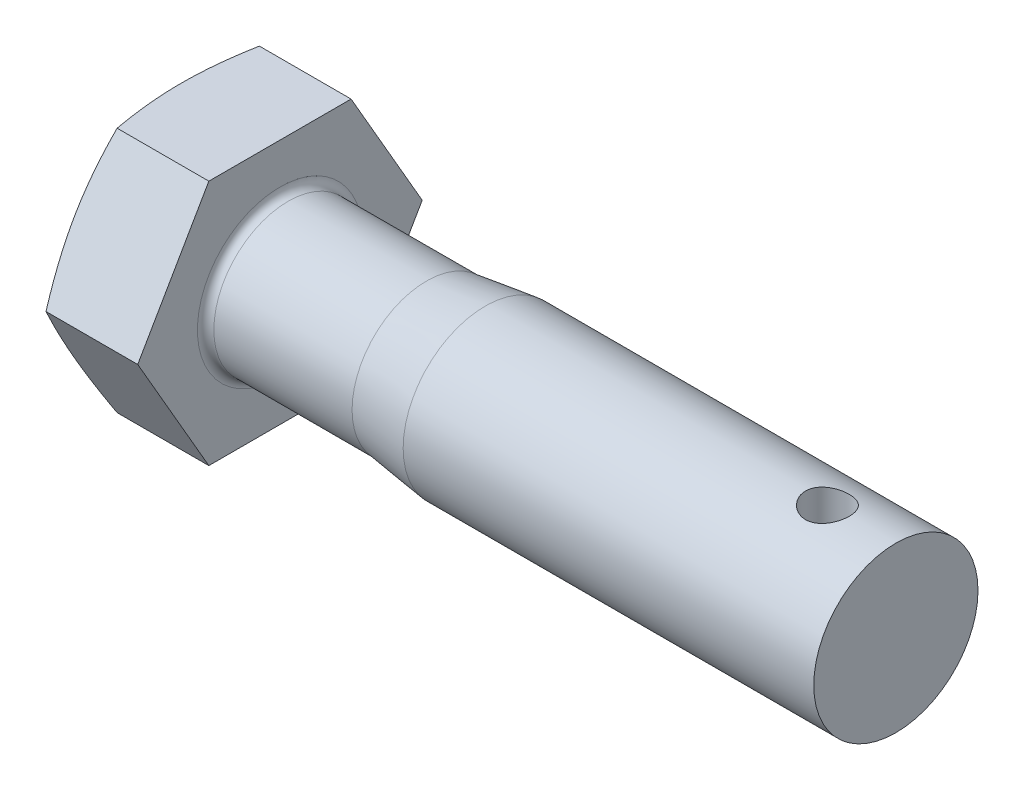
ISO-10303-21;
HEADER;
FILE_DESCRIPTION(('STEP AP214'),'2;1');
FILE_NAME('part.step','',(''),(''),'','','');
FILE_SCHEMA(('AUTOMOTIVE_DESIGN { 1 0 10303 214 1 1 1 1 }'));
ENDSEC;
DATA;
#1=APPLICATION_CONTEXT('core data for automotive mechanical design processes');
#2=APPLICATION_PROTOCOL_DEFINITION('international standard','automotive_design',2000,#1);
#3=PRODUCT_CONTEXT('',#1,'mechanical');
#4=PRODUCT('Part','Part','',(#3));
#5=PRODUCT_RELATED_PRODUCT_CATEGORY('part','',(#4));
#6=PRODUCT_DEFINITION_FORMATION('','',#4);
#7=PRODUCT_DEFINITION_CONTEXT('part definition',#1,'design');
#8=PRODUCT_DEFINITION('design','',#6,#7);
#9=PRODUCT_DEFINITION_SHAPE('','',#8);
#10=(LENGTH_UNIT() NAMED_UNIT(*) SI_UNIT(.MILLI.,.METRE.));
#11=(NAMED_UNIT(*) PLANE_ANGLE_UNIT() SI_UNIT($,.RADIAN.));
#12=(NAMED_UNIT(*) SI_UNIT($,.STERADIAN.) SOLID_ANGLE_UNIT());
#13=UNCERTAINTY_MEASURE_WITH_UNIT(LENGTH_MEASURE(1.E-05),#10,'distance_accuracy_value','');
#14=(GEOMETRIC_REPRESENTATION_CONTEXT(3) GLOBAL_UNCERTAINTY_ASSIGNED_CONTEXT((#13)) GLOBAL_UNIT_ASSIGNED_CONTEXT((#10,
#11,#12)) REPRESENTATION_CONTEXT('',''));
#15=CARTESIAN_POINT('',(0.,0.,0.));
#16=DIRECTION('',(0.,0.,1.));
#17=DIRECTION('',(1.,0.,0.));
#18=AXIS2_PLACEMENT_3D('',#15,#16,#17);
#19=CARTESIAN_POINT('',(0.,-9.,-5.19615242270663));
#20=DIRECTION('',(1.,0.,0.));
#21=DIRECTION('',(0.,0.,-1.));
#22=AXIS2_PLACEMENT_3D('',#19,#20,#21);
#23=PLANE('',#22);
#24=CARTESIAN_POINT('',(0.,0.,0.));
#25=DIRECTION('',(-1.,0.,0.));
#26=DIRECTION('',(0.,0.,1.));
#27=AXIS2_PLACEMENT_3D('',#24,#25,#26);
#28=CIRCLE('',#27,8.2);
#29=CARTESIAN_POINT('',(0.,0.,8.2));
#30=VERTEX_POINT('',#29);
#31=EDGE_CURVE('E98',#30,#30,#28,.T.);
#32=ORIENTED_EDGE('',*,*,#31,.T.);
#33=EDGE_LOOP('',(#32));
#34=FACE_BOUND('',#33,.T.);
#35=CARTESIAN_POINT('',(0.,0.,0.));
#36=DIRECTION('',(1.,0.,0.));
#37=DIRECTION('',(0.,0.,-1.));
#38=AXIS2_PLACEMENT_3D('',#35,#36,#37);
#39=CIRCLE('',#38,6.85);
#40=CARTESIAN_POINT('',(0.,0.,-6.85));
#41=VERTEX_POINT('',#40);
#42=EDGE_CURVE('E231',#41,#41,#39,.T.);
#43=ORIENTED_EDGE('',*,*,#42,.T.);
#44=EDGE_LOOP('',(#43));
#45=FACE_BOUND('',#44,.T.);
#46=ADVANCED_FACE('F32',(#34,#45),#23,.F.);
#47=CARTESIAN_POINT('',(7.5,-9.,5.19615242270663));
#48=DIRECTION('',(0.,1.,0.));
#49=DIRECTION('',(0.,0.,1.));
#50=AXIS2_PLACEMENT_3D('',#47,#48,#49);
#51=PLANE('',#50);
#52=CARTESIAN_POINT('',(2.99064695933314,-9.,-13.7298648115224));
#53=CARTESIAN_POINT('',(2.86681811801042,-9.,-13.3229547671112));
#54=CARTESIAN_POINT('',(2.74444035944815,-9.,-12.9155948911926));
#55=CARTESIAN_POINT('',(2.50338984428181,-9.,-12.0997465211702));
#56=CARTESIAN_POINT('',(2.384717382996,-9.,-11.6912579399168));
#57=CARTESIAN_POINT('',(2.15168119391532,-9.,-10.8722179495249));
#58=CARTESIAN_POINT('',(2.03732599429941,-9.,-10.461664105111));
#59=CARTESIAN_POINT('',(1.81427035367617,-9.,-9.63902527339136));
#60=CARTESIAN_POINT('',(1.70556981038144,-9.,-9.22694031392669));
#61=CARTESIAN_POINT('',(1.49653390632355,-9.,-8.40611060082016));
#62=CARTESIAN_POINT('',(1.39611119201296,-9.,-7.99738820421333));
#63=CARTESIAN_POINT('',(1.20385742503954,-9.,-7.17790644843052));
#64=CARTESIAN_POINT('',(1.11202651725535,-9.,-6.76714705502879));
#65=CARTESIAN_POINT('',(0.939106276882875,-9.,-5.94350445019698));
#66=CARTESIAN_POINT('',(0.858013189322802,-9.,-5.5306220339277));
#67=CARTESIAN_POINT('',(0.709045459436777,-9.,-4.70246163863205));
#68=CARTESIAN_POINT('',(0.641170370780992,-9.,-4.28718374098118));
#69=CARTESIAN_POINT('',(0.528125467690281,-9.,-3.5010438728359));
#70=CARTESIAN_POINT('',(0.481262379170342,-9.,-3.13042767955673));
#71=CARTESIAN_POINT('',(0.40202672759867,-9.,-2.38763662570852));
#72=CARTESIAN_POINT('',(0.369653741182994,-9.,-2.01546181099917));
#73=CARTESIAN_POINT('',(0.32095772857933,-9.,-1.27030896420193));
#74=CARTESIAN_POINT('',(0.304623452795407,-9.,-0.897331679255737));
#75=CARTESIAN_POINT('',(0.288831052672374,-9.,-0.151016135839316));
#76=CARTESIAN_POINT('',(0.289372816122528,-9.,0.222322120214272));
#77=CARTESIAN_POINT('',(0.307348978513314,-9.,0.970502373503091));
#78=CARTESIAN_POINT('',(0.324870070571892,-9.,1.34534225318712));
#79=CARTESIAN_POINT('',(0.375999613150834,-9.,2.09391368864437));
#80=CARTESIAN_POINT('',(0.409608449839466,-9.,2.46764521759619));
#81=CARTESIAN_POINT('',(0.491347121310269,-9.,3.21381849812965));
#82=CARTESIAN_POINT('',(0.539489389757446,-9.,3.58625886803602));
#83=CARTESIAN_POINT('',(0.648350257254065,-9.,4.32927613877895));
#84=CARTESIAN_POINT('',(0.709068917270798,-9.,4.69985303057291));
#85=CARTESIAN_POINT('',(0.845019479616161,-9.,5.46095124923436));
#86=CARTESIAN_POINT('',(0.920897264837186,-9.,5.85135619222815));
#87=CARTESIAN_POINT('',(1.08241874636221,-9.,6.63015355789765));
#88=CARTESIAN_POINT('',(1.16806318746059,-9.,7.01854582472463));
#89=CARTESIAN_POINT('',(1.34731089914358,-9.,7.79359854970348));
#90=CARTESIAN_POINT('',(1.440916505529,-9.,8.18025846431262));
#91=CARTESIAN_POINT('',(1.63455842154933,-9.,8.95194677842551));
#92=CARTESIAN_POINT('',(1.73459457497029,-9.,9.33697521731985));
#93=CARTESIAN_POINT('',(1.94002323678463,-9.,10.1061283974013));
#94=CARTESIAN_POINT('',(2.04542249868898,-9.,10.4902513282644));
#95=CARTESIAN_POINT('',(2.26049354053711,-9.,11.2572975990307));
#96=CARTESIAN_POINT('',(2.37016533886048,-9.,11.6402209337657));
#97=CARTESIAN_POINT('',(2.59299503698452,-9.,12.4049775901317));
#98=CARTESIAN_POINT('',(2.70615232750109,-9.,12.7868110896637));
#99=CARTESIAN_POINT('',(2.93536874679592,-9.,13.5496070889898));
#100=CARTESIAN_POINT('',(3.05142789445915,-9.,13.9305695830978));
#101=CARTESIAN_POINT('',(3.4005426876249,-9.,15.0637009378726));
#102=CARTESIAN_POINT('',(3.6370911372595,-9.,15.8147934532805));
#103=CARTESIAN_POINT('',(4.11685079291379,-9.,17.31487684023));
#104=CARTESIAN_POINT('',(4.36006232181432,-9.,18.063867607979));
#105=CARTESIAN_POINT('',(4.85043402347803,-9.,19.5573981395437));
#106=CARTESIAN_POINT('',(5.09757565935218,-9.,20.3019439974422));
#107=CARTESIAN_POINT('',(5.47101079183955,-9.,21.4178157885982));
#108=CARTESIAN_POINT('',(5.59593784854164,-9.,21.7896002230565));
#109=CARTESIAN_POINT('',(5.84659472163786,-9.,22.5328974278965));
#110=CARTESIAN_POINT('',(5.9723245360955,-9.,22.9044101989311));
#111=CARTESIAN_POINT('',(6.0984020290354,-9.,23.2758050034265));
#112=B_SPLINE_CURVE_WITH_KNOTS('',3,(#52,#53,#54,#55,#56,#57,#58,#59,#60,#61,#62,#63,#64,#65,
#66,#67,#68,#69,#70,#71,#72,#73,#74,#75,#76,#77,#78,#79,#80,#81,#82,#83,#84,#85,#86,#87,#88,#89,
#90,#91,#92,#93,#94,#95,#96,#97,#98,#99,#100,#101,#102,#103,#104,#105,#106,#107,#108,#109,#110,
#111),.UNSPECIFIED.,.F.,.F.,(4,2,2,2,2,2,2,2,2,2,2,2,2,2,2,2,2,2,2,2,2,2,2,2,2,2,2,2,2,4),(0.,
1.27601235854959,2.55212615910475,3.83064128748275,5.10913328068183,6.37169542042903,
7.63427884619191,8.89641957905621,10.1585176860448,11.278972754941,12.3993950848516,
13.5190309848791,14.6386594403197,15.7640347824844,16.8894371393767,18.0158050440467,
19.1421784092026,20.335155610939,21.5282238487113,22.7216433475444,23.9150338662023,
25.1099662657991,26.3049038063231,27.4996336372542,28.6943712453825,31.0567042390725,
33.4191519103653,35.7726141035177,36.9492501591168,38.1258833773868),.UNSPECIFIED.);
#113=CARTESIAN_POINT('',(0.797933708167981,-9.00000000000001,-5.19615242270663));
#114=VERTEX_POINT('',#113);
#115=CARTESIAN_POINT('',(0.79793370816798,-9.,5.19615242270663));
#116=VERTEX_POINT('',#115);
#117=EDGE_CURVE('E54',#114,#116,#112,.T.);
#118=ORIENTED_EDGE('',*,*,#117,.F.);
#119=DIRECTION('',(-1.,0.,0.));
#120=VECTOR('',#119,1.);
#121=CARTESIAN_POINT('',(7.5,-9.,-5.19615242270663));
#122=LINE('',#121,#120);
#123=CARTESIAN_POINT('',(7.5,-9.,-5.19615242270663));
#124=VERTEX_POINT('',#123);
#125=EDGE_CURVE('E123',#124,#114,#122,.T.);
#126=ORIENTED_EDGE('',*,*,#125,.F.);
#127=DIRECTION('',(0.,0.,-1.));
#128=VECTOR('',#127,1.);
#129=CARTESIAN_POINT('',(7.5,-9.,5.19615242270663));
#130=LINE('',#129,#128);
#131=CARTESIAN_POINT('',(7.5,-9.,5.19615242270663));
#132=VERTEX_POINT('',#131);
#133=EDGE_CURVE('E260',#132,#124,#130,.T.);
#134=ORIENTED_EDGE('',*,*,#133,.F.);
#135=DIRECTION('',(-1.,0.,0.));
#136=VECTOR('',#135,1.);
#137=CARTESIAN_POINT('',(7.5,-9.,5.19615242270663));
#138=LINE('',#137,#136);
#139=EDGE_CURVE('E111',#132,#116,#138,.T.);
#140=ORIENTED_EDGE('',*,*,#139,.T.);
#141=EDGE_LOOP('',(#118,#126,#134,#140));
#142=FACE_BOUND('',#141,.T.);
#143=ADVANCED_FACE('F34',(#142),#51,.F.);
#144=CARTESIAN_POINT('',(7.5,-9.,-5.19615242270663));
#145=DIRECTION('',(0.,0.5,0.866025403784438));
#146=DIRECTION('',(0.,-0.866025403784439,0.5));
#147=AXIS2_PLACEMENT_3D('',#144,#145,#146);
#148=PLANE('',#147);
#149=CARTESIAN_POINT('',(0.79797573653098,0.000200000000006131,-10.3924203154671));
#150=CARTESIAN_POINT('',(0.719623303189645,-0.372526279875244,-10.1772266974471));
#151=CARTESIAN_POINT('',(0.648348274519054,-0.746481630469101,-9.96132347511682));
#152=CARTESIAN_POINT('',(0.522950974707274,-1.49682376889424,-9.52811323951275));
#153=CARTESIAN_POINT('',(0.46884212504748,-1.87321222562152,-9.31080526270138));
#154=CARTESIAN_POINT('',(0.381322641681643,-2.62424363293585,-8.87719707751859));
#155=CARTESIAN_POINT('',(0.347721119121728,-2.9988694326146,-8.66090677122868));
#156=CARTESIAN_POINT('',(0.302652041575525,-3.74899707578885,-8.22782037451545));
#157=CARTESIAN_POINT('',(0.291176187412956,-4.12449853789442,-8.0110245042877));
#158=CARTESIAN_POINT('',(0.291176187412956,-4.87550146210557,-7.5774327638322));
#159=CARTESIAN_POINT('',(0.302652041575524,-5.25100292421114,-7.36063689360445));
#160=CARTESIAN_POINT('',(0.347721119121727,-6.00113056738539,-6.92755049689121));
#161=CARTESIAN_POINT('',(0.381322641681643,-6.37575636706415,-6.71126019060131));
#162=CARTESIAN_POINT('',(0.468842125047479,-7.12678777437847,-6.27765200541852));
#163=CARTESIAN_POINT('',(0.522950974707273,-7.50317623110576,-6.06034402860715));
#164=CARTESIAN_POINT('',(0.648348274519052,-8.25351836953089,-5.62713379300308));
#165=CARTESIAN_POINT('',(0.719623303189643,-8.62747372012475,-5.41123057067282));
#166=CARTESIAN_POINT('',(0.797975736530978,-9.0002,-5.19603695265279));
#167=B_SPLINE_CURVE_WITH_KNOTS('',3,(#149,#150,#151,#152,#153,#154,#155,#156,#157,#158,#159,
#160,#161,#162,#163,#164,#165,#166),.UNSPECIFIED.,.F.,.F.,(4,2,2,2,2,2,2,2,4),(0.,
1.3125188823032,2.62606145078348,3.92718284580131,5.22781610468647,6.52844936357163,
7.82957075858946,9.14311332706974,10.4556322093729),.UNSPECIFIED.);
#168=CARTESIAN_POINT('',(0.797933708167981,0.,-10.3923048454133));
#169=VERTEX_POINT('',#168);
#170=EDGE_CURVE('E193',#169,#114,#167,.T.);
#171=ORIENTED_EDGE('',*,*,#170,.F.);
#172=DIRECTION('',(-1.,0.,0.));
#173=VECTOR('',#172,1.);
#174=CARTESIAN_POINT('',(7.5,0.,-10.3923048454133));
#175=LINE('',#174,#173);
#176=CARTESIAN_POINT('',(7.5,0.,-10.3923048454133));
#177=VERTEX_POINT('',#176);
#178=EDGE_CURVE('E120',#177,#169,#175,.T.);
#179=ORIENTED_EDGE('',*,*,#178,.F.);
#180=DIRECTION('',(0.,0.866025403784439,-0.5));
#181=VECTOR('',#180,1.);
#182=CARTESIAN_POINT('',(7.5,-9.,-5.19615242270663));
#183=LINE('',#182,#181);
#184=EDGE_CURVE('E261',#124,#177,#183,.T.);
#185=ORIENTED_EDGE('',*,*,#184,.F.);
#186=ORIENTED_EDGE('',*,*,#125,.T.);
#187=EDGE_LOOP('',(#171,#179,#185,#186));
#188=FACE_BOUND('',#187,.T.);
#189=ADVANCED_FACE('F201',(#188),#148,.F.);
#190=CARTESIAN_POINT('',(7.5,0.,-10.3923048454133));
#191=DIRECTION('',(0.,-0.5,0.866025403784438));
#192=DIRECTION('',(0.,-0.866025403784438,-0.5));
#193=AXIS2_PLACEMENT_3D('',#190,#191,#192);
#194=PLANE('',#193);
#195=CARTESIAN_POINT('',(0.79797573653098,9.0002,-5.19603695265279));
#196=CARTESIAN_POINT('',(0.719623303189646,8.62747372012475,-5.41123057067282));
#197=CARTESIAN_POINT('',(0.648348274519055,8.25351836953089,-5.62713379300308));
#198=CARTESIAN_POINT('',(0.522950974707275,7.50317623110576,-6.06034402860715));
#199=CARTESIAN_POINT('',(0.46884212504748,7.12678777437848,-6.27765200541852));
#200=CARTESIAN_POINT('',(0.381322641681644,6.37575636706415,-6.7112601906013));
#201=CARTESIAN_POINT('',(0.347721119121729,6.0011305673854,-6.92755049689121));
#202=CARTESIAN_POINT('',(0.302652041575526,5.25100292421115,-7.36063689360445));
#203=CARTESIAN_POINT('',(0.291176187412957,4.87550146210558,-7.5774327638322));
#204=CARTESIAN_POINT('',(0.291176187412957,4.12449853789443,-8.0110245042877));
#205=CARTESIAN_POINT('',(0.302652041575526,3.74899707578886,-8.22782037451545));
#206=CARTESIAN_POINT('',(0.347721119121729,2.99886943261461,-8.66090677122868));
#207=CARTESIAN_POINT('',(0.381322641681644,2.62424363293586,-8.87719707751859));
#208=CARTESIAN_POINT('',(0.46884212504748,1.87321222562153,-9.31080526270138));
#209=CARTESIAN_POINT('',(0.522950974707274,1.49682376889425,-9.52811323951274));
#210=CARTESIAN_POINT('',(0.648348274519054,0.746481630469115,-9.96132347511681));
#211=CARTESIAN_POINT('',(0.719623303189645,0.372526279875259,-10.1772266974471));
#212=CARTESIAN_POINT('',(0.79797573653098,-0.000199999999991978,-10.3924203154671));
#213=B_SPLINE_CURVE_WITH_KNOTS('',3,(#195,#196,#197,#198,#199,#200,#201,#202,#203,#204,#205,
#206,#207,#208,#209,#210,#211,#212),.UNSPECIFIED.,.F.,.F.,(4,2,2,2,2,2,2,2,4),(0.,
1.3125188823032,2.62606145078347,3.9271828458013,5.22781610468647,6.52844936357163,
7.82957075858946,9.14311332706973,10.4556322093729),.UNSPECIFIED.);
#214=CARTESIAN_POINT('',(0.797933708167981,9.,-5.19615242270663));
#215=VERTEX_POINT('',#214);
#216=EDGE_CURVE('E187',#215,#169,#213,.T.);
#217=ORIENTED_EDGE('',*,*,#216,.F.);
#218=DIRECTION('',(-1.,0.,0.));
#219=VECTOR('',#218,1.);
#220=CARTESIAN_POINT('',(7.5,9.,-5.19615242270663));
#221=LINE('',#220,#219);
#222=CARTESIAN_POINT('',(7.5,9.,-5.19615242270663));
#223=VERTEX_POINT('',#222);
#224=EDGE_CURVE('E113',#223,#215,#221,.T.);
#225=ORIENTED_EDGE('',*,*,#224,.F.);
#226=DIRECTION('',(0.,0.866025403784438,0.5));
#227=VECTOR('',#226,1.);
#228=CARTESIAN_POINT('',(7.5,0.,-10.3923048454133));
#229=LINE('',#228,#227);
#230=EDGE_CURVE('E265',#177,#223,#229,.T.);
#231=ORIENTED_EDGE('',*,*,#230,.F.);
#232=ORIENTED_EDGE('',*,*,#178,.T.);
#233=EDGE_LOOP('',(#217,#225,#231,#232));
#234=FACE_BOUND('',#233,.T.);
#235=ADVANCED_FACE('F204',(#234),#194,.F.);
#236=CARTESIAN_POINT('',(7.5,9.,-5.19615242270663));
#237=DIRECTION('',(0.,-1.,0.));
#238=DIRECTION('',(0.,0.,-1.));
#239=AXIS2_PLACEMENT_3D('',#236,#237,#238);
#240=PLANE('',#239);
#241=CARTESIAN_POINT('',(2.99064695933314,9.,-13.7298648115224));
#242=CARTESIAN_POINT('',(2.86681811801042,9.,-13.3229547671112));
#243=CARTESIAN_POINT('',(2.74444035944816,9.,-12.9155948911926));
#244=CARTESIAN_POINT('',(2.50338984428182,9.,-12.0997465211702));
#245=CARTESIAN_POINT('',(2.384717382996,9.,-11.6912579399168));
#246=CARTESIAN_POINT('',(2.15168119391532,9.,-10.8722179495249));
#247=CARTESIAN_POINT('',(2.03732599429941,9.,-10.461664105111));
#248=CARTESIAN_POINT('',(1.81427035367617,9.,-9.63902527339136));
#249=CARTESIAN_POINT('',(1.70556981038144,9.,-9.22694031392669));
#250=CARTESIAN_POINT('',(1.49653390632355,9.,-8.40611060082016));
#251=CARTESIAN_POINT('',(1.39611119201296,9.,-7.99738820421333));
#252=CARTESIAN_POINT('',(1.20385742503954,9.,-7.17790644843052));
#253=CARTESIAN_POINT('',(1.11202651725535,9.,-6.76714705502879));
#254=CARTESIAN_POINT('',(0.939106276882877,9.,-5.94350445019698));
#255=CARTESIAN_POINT('',(0.858013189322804,9.,-5.5306220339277));
#256=CARTESIAN_POINT('',(0.709045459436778,9.,-4.70246163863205));
#257=CARTESIAN_POINT('',(0.641170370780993,9.,-4.28718374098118));
#258=CARTESIAN_POINT('',(0.528125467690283,9.,-3.5010438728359));
#259=CARTESIAN_POINT('',(0.481262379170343,9.,-3.13042767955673));
#260=CARTESIAN_POINT('',(0.402026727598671,9.,-2.38763662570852));
#261=CARTESIAN_POINT('',(0.369653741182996,9.,-2.01546181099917));
#262=CARTESIAN_POINT('',(0.320957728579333,9.,-1.27030896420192));
#263=CARTESIAN_POINT('',(0.304623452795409,9.,-0.897331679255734));
#264=CARTESIAN_POINT('',(0.288831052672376,9.,-0.151016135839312));
#265=CARTESIAN_POINT('',(0.28937281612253,9.,0.222322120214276));
#266=CARTESIAN_POINT('',(0.307348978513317,9.,0.970502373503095));
#267=CARTESIAN_POINT('',(0.324870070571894,9.,1.34534225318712));
#268=CARTESIAN_POINT('',(0.375999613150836,9.,2.09391368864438));
#269=CARTESIAN_POINT('',(0.409608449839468,9.,2.46764521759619));
#270=CARTESIAN_POINT('',(0.491347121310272,9.,3.21381849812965));
#271=CARTESIAN_POINT('',(0.539489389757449,9.,3.58625886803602));
#272=CARTESIAN_POINT('',(0.648350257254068,9.,4.32927613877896));
#273=CARTESIAN_POINT('',(0.709068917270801,9.,4.69985303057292));
#274=CARTESIAN_POINT('',(0.845019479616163,9.,5.46095124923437));
#275=CARTESIAN_POINT('',(0.920897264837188,9.,5.85135619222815));
#276=CARTESIAN_POINT('',(1.08241874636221,9.,6.63015355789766));
#277=CARTESIAN_POINT('',(1.16806318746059,9.,7.01854582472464));
#278=CARTESIAN_POINT('',(1.34731089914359,9.,7.79359854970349));
#279=CARTESIAN_POINT('',(1.440916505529,9.,8.18025846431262));
#280=CARTESIAN_POINT('',(1.63455842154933,9.,8.95194677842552));
#281=CARTESIAN_POINT('',(1.73459457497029,9.,9.33697521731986));
#282=CARTESIAN_POINT('',(1.94002323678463,9.,10.1061283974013));
#283=CARTESIAN_POINT('',(2.04542249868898,9.,10.4902513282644));
#284=CARTESIAN_POINT('',(2.26049354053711,9.,11.2572975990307));
#285=CARTESIAN_POINT('',(2.37016533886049,9.,11.6402209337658));
#286=CARTESIAN_POINT('',(2.59299503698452,9.,12.4049775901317));
#287=CARTESIAN_POINT('',(2.7061523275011,9.,12.7868110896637));
#288=CARTESIAN_POINT('',(2.93536874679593,9.,13.5496070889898));
#289=CARTESIAN_POINT('',(3.05142789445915,9.,13.9305695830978));
#290=CARTESIAN_POINT('',(3.4005426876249,9.,15.0637009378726));
#291=CARTESIAN_POINT('',(3.6370911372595,9.,15.8147934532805));
#292=CARTESIAN_POINT('',(4.11685079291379,9.,17.31487684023));
#293=CARTESIAN_POINT('',(4.36006232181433,9.,18.0638676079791));
#294=CARTESIAN_POINT('',(4.85043402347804,9.,19.5573981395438));
#295=CARTESIAN_POINT('',(5.09757565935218,9.,20.3019439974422));
#296=CARTESIAN_POINT('',(5.47101079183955,9.,21.4178157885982));
#297=CARTESIAN_POINT('',(5.59593784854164,9.,21.7896002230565));
#298=CARTESIAN_POINT('',(5.84659472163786,9.,22.5328974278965));
#299=CARTESIAN_POINT('',(5.9723245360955,9.,22.9044101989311));
#300=CARTESIAN_POINT('',(6.09840202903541,9.,23.2758050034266));
#301=B_SPLINE_CURVE_WITH_KNOTS('',3,(#241,#242,#243,#244,#245,#246,#247,#248,#249,#250,#251,
#252,#253,#254,#255,#256,#257,#258,#259,#260,#261,#262,#263,#264,#265,#266,#267,#268,#269,#270,
#271,#272,#273,#274,#275,#276,#277,#278,#279,#280,#281,#282,#283,#284,#285,#286,#287,#288,#289,
#290,#291,#292,#293,#294,#295,#296,#297,#298,#299,#300),.UNSPECIFIED.,.F.,.F.,(4,2,2,2,2,2,2,2,
2,2,2,2,2,2,2,2,2,2,2,2,2,2,2,2,2,2,2,2,2,4),(0.,1.27601235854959,2.55212615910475,
3.83064128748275,5.10913328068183,6.37169542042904,7.63427884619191,8.89641957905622,
10.1585176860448,11.278972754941,12.3993950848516,13.5190309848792,14.6386594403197,
15.7640347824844,16.8894371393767,18.0158050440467,19.1421784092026,20.335155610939,
21.5282238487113,22.7216433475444,23.9150338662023,25.1099662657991,26.3049038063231,
27.4996336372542,28.6943712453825,31.0567042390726,33.4191519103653,35.7726141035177,
36.9492501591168,38.1258833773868),.UNSPECIFIED.);
#302=CARTESIAN_POINT('',(0.797933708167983,9.,5.19615242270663));
#303=VERTEX_POINT('',#302);
#304=EDGE_CURVE('E108',#303,#215,#301,.F.);
#305=ORIENTED_EDGE('',*,*,#304,.F.);
#306=DIRECTION('',(-1.,0.,0.));
#307=VECTOR('',#306,1.);
#308=CARTESIAN_POINT('',(7.5,9.,5.19615242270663));
#309=LINE('',#308,#307);
#310=CARTESIAN_POINT('',(7.5,9.,5.19615242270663));
#311=VERTEX_POINT('',#310);
#312=EDGE_CURVE('E107',#311,#303,#309,.T.);
#313=ORIENTED_EDGE('',*,*,#312,.F.);
#314=DIRECTION('',(0.,0.,1.));
#315=VECTOR('',#314,1.);
#316=CARTESIAN_POINT('',(7.5,9.,-5.19615242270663));
#317=LINE('',#316,#315);
#318=EDGE_CURVE('E267',#223,#311,#317,.T.);
#319=ORIENTED_EDGE('',*,*,#318,.F.);
#320=ORIENTED_EDGE('',*,*,#224,.T.);
#321=EDGE_LOOP('',(#305,#313,#319,#320));
#322=FACE_BOUND('',#321,.T.);
#323=ADVANCED_FACE('F208',(#322),#240,.F.);
#324=CARTESIAN_POINT('',(7.5,9.,5.19615242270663));
#325=DIRECTION('',(0.,-0.5,-0.866025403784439));
#326=DIRECTION('',(0.,0.866025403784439,-0.5));
#327=AXIS2_PLACEMENT_3D('',#324,#325,#326);
#328=PLANE('',#327);
#329=CARTESIAN_POINT('',(0.797975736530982,-0.000199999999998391,10.3924203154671));
#330=CARTESIAN_POINT('',(0.719623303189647,0.372526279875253,10.1772266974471));
#331=CARTESIAN_POINT('',(0.648348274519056,0.746481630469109,9.96132347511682));
#332=CARTESIAN_POINT('',(0.522950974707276,1.49682376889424,9.52811323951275));
#333=CARTESIAN_POINT('',(0.468842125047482,1.87321222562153,9.31080526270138));
#334=CARTESIAN_POINT('',(0.381322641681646,2.62424363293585,8.87719707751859));
#335=CARTESIAN_POINT('',(0.347721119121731,2.99886943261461,8.66090677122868));
#336=CARTESIAN_POINT('',(0.302652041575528,3.74899707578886,8.22782037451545));
#337=CARTESIAN_POINT('',(0.291176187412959,4.12449853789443,8.0110245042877));
#338=CARTESIAN_POINT('',(0.291176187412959,4.87550146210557,7.5774327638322));
#339=CARTESIAN_POINT('',(0.302652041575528,5.25100292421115,7.36063689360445));
#340=CARTESIAN_POINT('',(0.347721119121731,6.0011305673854,6.92755049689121));
#341=CARTESIAN_POINT('',(0.381322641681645,6.37575636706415,6.71126019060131));
#342=CARTESIAN_POINT('',(0.468842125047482,7.12678777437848,6.27765200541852));
#343=CARTESIAN_POINT('',(0.522950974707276,7.50317623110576,6.06034402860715));
#344=CARTESIAN_POINT('',(0.648348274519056,8.25351836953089,5.62713379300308));
#345=CARTESIAN_POINT('',(0.719623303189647,8.62747372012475,5.41123057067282));
#346=CARTESIAN_POINT('',(0.797975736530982,9.0002,5.19603695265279));
#347=B_SPLINE_CURVE_WITH_KNOTS('',3,(#329,#330,#331,#332,#333,#334,#335,#336,#337,#338,#339,
#340,#341,#342,#343,#344,#345,#346),.UNSPECIFIED.,.F.,.F.,(4,2,2,2,2,2,2,2,4),(0.,
1.3125188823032,2.62606145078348,3.92718284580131,5.22781610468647,6.52844936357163,
7.82957075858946,9.14311332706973,10.4556322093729),.UNSPECIFIED.);
#348=CARTESIAN_POINT('',(0.797933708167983,0.,10.3923048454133));
#349=VERTEX_POINT('',#348);
#350=EDGE_CURVE('E93',#349,#303,#347,.T.);
#351=ORIENTED_EDGE('',*,*,#350,.F.);
#352=DIRECTION('',(-1.,0.,0.));
#353=VECTOR('',#352,1.);
#354=CARTESIAN_POINT('',(7.5,0.,10.3923048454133));
#355=LINE('',#354,#353);
#356=CARTESIAN_POINT('',(7.5,0.,10.3923048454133));
#357=VERTEX_POINT('',#356);
#358=EDGE_CURVE('E105',#357,#349,#355,.T.);
#359=ORIENTED_EDGE('',*,*,#358,.F.);
#360=DIRECTION('',(0.,-0.866025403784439,0.5));
#361=VECTOR('',#360,1.);
#362=CARTESIAN_POINT('',(7.5,9.,5.19615242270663));
#363=LINE('',#362,#361);
#364=EDGE_CURVE('E269',#311,#357,#363,.T.);
#365=ORIENTED_EDGE('',*,*,#364,.F.);
#366=ORIENTED_EDGE('',*,*,#312,.T.);
#367=EDGE_LOOP('',(#351,#359,#365,#366));
#368=FACE_BOUND('',#367,.T.);
#369=ADVANCED_FACE('F103',(#368),#328,.F.);
#370=CARTESIAN_POINT('',(7.5,0.,10.3923048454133));
#371=DIRECTION('',(0.,0.5,-0.866025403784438));
#372=DIRECTION('',(0.,0.866025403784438,0.5));
#373=AXIS2_PLACEMENT_3D('',#370,#371,#372);
#374=PLANE('',#373);
#375=CARTESIAN_POINT('',(0.797975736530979,-9.0002,5.19603695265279));
#376=CARTESIAN_POINT('',(0.719623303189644,-8.62747372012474,5.41123057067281));
#377=CARTESIAN_POINT('',(0.648348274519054,-8.25351836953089,5.62713379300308));
#378=CARTESIAN_POINT('',(0.522950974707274,-7.50317623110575,6.06034402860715));
#379=CARTESIAN_POINT('',(0.46884212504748,-7.12678777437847,6.27765200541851));
#380=CARTESIAN_POINT('',(0.381322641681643,-6.37575636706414,6.7112601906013));
#381=CARTESIAN_POINT('',(0.347721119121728,-6.00113056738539,6.92755049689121));
#382=CARTESIAN_POINT('',(0.302652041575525,-5.25100292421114,7.36063689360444));
#383=CARTESIAN_POINT('',(0.291176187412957,-4.87550146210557,7.57743276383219));
#384=CARTESIAN_POINT('',(0.291176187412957,-4.12449853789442,8.0110245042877));
#385=CARTESIAN_POINT('',(0.302652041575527,-3.74899707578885,8.22782037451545));
#386=CARTESIAN_POINT('',(0.34772111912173,-2.9988694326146,8.66090677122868));
#387=CARTESIAN_POINT('',(0.381322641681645,-2.62424363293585,8.87719707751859));
#388=CARTESIAN_POINT('',(0.468842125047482,-1.87321222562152,9.31080526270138));
#389=CARTESIAN_POINT('',(0.522950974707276,-1.49682376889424,9.52811323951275));
#390=CARTESIAN_POINT('',(0.648348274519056,-0.746481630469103,9.96132347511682));
#391=CARTESIAN_POINT('',(0.719623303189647,-0.372526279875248,10.1772266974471));
#392=CARTESIAN_POINT('',(0.797975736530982,0.000200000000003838,10.3924203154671));
#393=B_SPLINE_CURVE_WITH_KNOTS('',3,(#375,#376,#377,#378,#379,#380,#381,#382,#383,#384,#385,
#386,#387,#388,#389,#390,#391,#392),.UNSPECIFIED.,.F.,.F.,(4,2,2,2,2,2,2,2,4),(0.,
1.3125188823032,2.62606145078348,3.92718284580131,5.22781610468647,6.52844936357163,
7.82957075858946,9.14311332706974,10.4556322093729),.UNSPECIFIED.);
#394=EDGE_CURVE('E90',#116,#349,#393,.T.);
#395=ORIENTED_EDGE('',*,*,#394,.F.);
#396=ORIENTED_EDGE('',*,*,#139,.F.);
#397=DIRECTION('',(0.,-0.866025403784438,-0.5));
#398=VECTOR('',#397,1.);
#399=CARTESIAN_POINT('',(7.5,0.,10.3923048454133));
#400=LINE('',#399,#398);
#401=EDGE_CURVE('E62',#357,#132,#400,.T.);
#402=ORIENTED_EDGE('',*,*,#401,.F.);
#403=ORIENTED_EDGE('',*,*,#358,.T.);
#404=EDGE_LOOP('',(#395,#396,#402,#403));
#405=FACE_BOUND('',#404,.T.);
#406=ADVANCED_FACE('F110',(#405),#374,.F.);
#407=CARTESIAN_POINT('',(7.5,-9.,-5.19615242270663));
#408=DIRECTION('',(1.,0.,0.));
#409=DIRECTION('',(0.,0.,-1.));
#410=AXIS2_PLACEMENT_3D('',#407,#408,#409);
#411=PLANE('',#410);
#412=CARTESIAN_POINT('',(7.5,0.,0.));
#413=DIRECTION('',(1.,0.,0.));
#414=DIRECTION('',(0.,0.,-1.));
#415=AXIS2_PLACEMENT_3D('',#412,#413,#414);
#416=CIRCLE('',#415,6.0315);
#417=CARTESIAN_POINT('',(7.5,0.,-6.0315));
#418=VERTEX_POINT('',#417);
#419=EDGE_CURVE('E46',#418,#418,#416,.F.);
#420=ORIENTED_EDGE('',*,*,#419,.T.);
#421=EDGE_LOOP('',(#420));
#422=FACE_BOUND('',#421,.T.);
#423=ORIENTED_EDGE('',*,*,#133,.T.);
#424=ORIENTED_EDGE('',*,*,#184,.T.);
#425=ORIENTED_EDGE('',*,*,#230,.T.);
#426=ORIENTED_EDGE('',*,*,#318,.T.);
#427=ORIENTED_EDGE('',*,*,#364,.T.);
#428=ORIENTED_EDGE('',*,*,#401,.T.);
#429=EDGE_LOOP('',(#423,#424,#425,#426,#427,#428));
#430=FACE_BOUND('',#429,.T.);
#431=ADVANCED_FACE('F164',(#422,#430),#411,.T.);
#432=CARTESIAN_POINT('',(0.,0.,0.));
#433=DIRECTION('',(1.,0.,0.));
#434=DIRECTION('',(0.,0.,-1.));
#435=AXIS2_PLACEMENT_3D('',#432,#433,#434);
#436=CONICAL_SURFACE('',#435,8.2,1.22173047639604);
#437=ORIENTED_EDGE('',*,*,#31,.F.);
#438=EDGE_LOOP('',(#437));
#439=FACE_BOUND('',#438,.T.);
#440=ORIENTED_EDGE('',*,*,#117,.T.);
#441=ORIENTED_EDGE('',*,*,#394,.T.);
#442=ORIENTED_EDGE('',*,*,#350,.T.);
#443=ORIENTED_EDGE('',*,*,#304,.T.);
#444=ORIENTED_EDGE('',*,*,#216,.T.);
#445=ORIENTED_EDGE('',*,*,#170,.T.);
#446=EDGE_LOOP('',(#440,#441,#442,#443,#444,#445));
#447=FACE_BOUND('',#446,.T.);
#448=ADVANCED_FACE('F92',(#439,#447),#436,.T.);
#449=CARTESIAN_POINT('',(1.5,0.,0.));
#450=DIRECTION('',(-1.,0.,0.));
#451=DIRECTION('',(0.,0.,1.));
#452=AXIS2_PLACEMENT_3D('',#449,#450,#451);
#453=CYLINDRICAL_SURFACE('',#452,6.85);
#454=CARTESIAN_POINT('',(1.5,0.,0.));
#455=DIRECTION('',(1.,0.,0.));
#456=DIRECTION('',(0.,0.,-1.));
#457=AXIS2_PLACEMENT_3D('',#454,#455,#456);
#458=CIRCLE('',#457,6.85);
#459=CARTESIAN_POINT('',(1.5,0.,-6.85));
#460=VERTEX_POINT('',#459);
#461=EDGE_CURVE('E233',#460,#460,#458,.T.);
#462=ORIENTED_EDGE('',*,*,#461,.T.);
#463=EDGE_LOOP('',(#462));
#464=FACE_BOUND('',#463,.T.);
#465=ORIENTED_EDGE('',*,*,#42,.F.);
#466=EDGE_LOOP('',(#465));
#467=FACE_BOUND('',#466,.T.);
#468=ADVANCED_FACE('F157',(#464,#467),#453,.F.);
#469=CARTESIAN_POINT('',(1.5,0.,0.));
#470=DIRECTION('',(1.,0.,0.));
#471=DIRECTION('',(0.,0.,-1.));
#472=AXIS2_PLACEMENT_3D('',#469,#470,#471);
#473=PLANE('',#472);
#474=ORIENTED_EDGE('',*,*,#461,.F.);
#475=EDGE_LOOP('',(#474));
#476=FACE_BOUND('',#475,.T.);
#477=ADVANCED_FACE('F153',(#476),#473,.F.);
#478=CARTESIAN_POINT('',(18.2,0.,0.));
#479=DIRECTION('',(1.,0.,0.));
#480=DIRECTION('',(0.,0.,-1.));
#481=AXIS2_PLACEMENT_3D('',#478,#479,#480);
#482=CONICAL_SURFACE('',#481,5.4315,0.131446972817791);
#483=CARTESIAN_POINT('',(22.5,0.,0.));
#484=DIRECTION('',(-1.,0.,0.));
#485=DIRECTION('',(0.,0.,1.));
#486=AXIS2_PLACEMENT_3D('',#483,#484,#485);
#487=CIRCLE('',#486,6.);
#488=CARTESIAN_POINT('',(22.5,0.,5.99999999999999));
#489=VERTEX_POINT('',#488);
#490=EDGE_CURVE('E234',#489,#489,#487,.T.);
#491=ORIENTED_EDGE('',*,*,#490,.T.);
#492=EDGE_LOOP('',(#491));
#493=FACE_BOUND('',#492,.T.);
#494=CARTESIAN_POINT('',(18.2,0.,0.));
#495=DIRECTION('',(-1.,0.,0.));
#496=DIRECTION('',(0.,0.,1.));
#497=AXIS2_PLACEMENT_3D('',#494,#495,#496);
#498=CIRCLE('',#497,5.4315);
#499=CARTESIAN_POINT('',(18.2,0.,5.4315));
#500=VERTEX_POINT('',#499);
#501=EDGE_CURVE('E239',#500,#500,#498,.T.);
#502=ORIENTED_EDGE('',*,*,#501,.F.);
#503=EDGE_LOOP('',(#502));
#504=FACE_BOUND('',#503,.T.);
#505=ADVANCED_FACE('F149',(#493,#504),#482,.T.);
#506=CARTESIAN_POINT('',(0.,0.,0.));
#507=DIRECTION('',(-1.,0.,0.));
#508=DIRECTION('',(0.,0.,1.));
#509=AXIS2_PLACEMENT_3D('',#506,#507,#508);
#510=CYLINDRICAL_SURFACE('',#509,5.4315);
#511=CARTESIAN_POINT('',(8.1,0.,0.));
#512=DIRECTION('',(1.,0.,0.));
#513=DIRECTION('',(0.,0.,-1.));
#514=AXIS2_PLACEMENT_3D('',#511,#512,#513);
#515=CIRCLE('',#514,5.4315);
#516=CARTESIAN_POINT('',(8.1,0.,-5.4315));
#517=VERTEX_POINT('',#516);
#518=EDGE_CURVE('E11',#517,#517,#515,.T.);
#519=ORIENTED_EDGE('',*,*,#518,.T.);
#520=EDGE_LOOP('',(#519));
#521=FACE_BOUND('',#520,.T.);
#522=ORIENTED_EDGE('',*,*,#501,.T.);
#523=EDGE_LOOP('',(#522));
#524=FACE_BOUND('',#523,.T.);
#525=ADVANCED_FACE('F145',(#521,#524),#510,.T.);
#526=CARTESIAN_POINT('',(52.5,0.,0.));
#527=DIRECTION('',(1.,0.,0.));
#528=DIRECTION('',(0.,0.,-1.));
#529=AXIS2_PLACEMENT_3D('',#526,#527,#528);
#530=PLANE('',#529);
#531=CARTESIAN_POINT('',(52.5,0.,0.));
#532=DIRECTION('',(1.,0.,0.));
#533=DIRECTION('',(0.,0.,-1.));
#534=AXIS2_PLACEMENT_3D('',#531,#532,#533);
#535=CIRCLE('',#534,6.);
#536=CARTESIAN_POINT('',(52.5,0.,-6.));
#537=VERTEX_POINT('',#536);
#538=EDGE_CURVE('E256',#537,#537,#535,.T.);
#539=ORIENTED_EDGE('',*,*,#538,.T.);
#540=EDGE_LOOP('',(#539));
#541=FACE_BOUND('',#540,.T.);
#542=ADVANCED_FACE('F148',(#541),#530,.T.);
#543=CARTESIAN_POINT('',(52.5,0.,0.));
#544=DIRECTION('',(-1.,0.,0.));
#545=DIRECTION('',(0.,0.,1.));
#546=AXIS2_PLACEMENT_3D('',#543,#544,#545);
#547=CYLINDRICAL_SURFACE('',#546,6.);
#548=CARTESIAN_POINT('',(47.5,-5.78273291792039,1.6));
#549=CARTESIAN_POINT('',(47.588140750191,-5.7827344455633,1.59999787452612));
#550=CARTESIAN_POINT('',(47.6763040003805,-5.78477011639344,1.59269194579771));
#551=CARTESIAN_POINT('',(47.8500843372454,-5.79266848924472,1.56371666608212));
#552=CARTESIAN_POINT('',(47.9357001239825,-5.79853311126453,1.54204010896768));
#553=CARTESIAN_POINT('',(48.1018464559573,-5.81337900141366,1.48508676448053));
#554=CARTESIAN_POINT('',(48.1823839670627,-5.82235588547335,1.4498291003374));
#555=CARTESIAN_POINT('',(48.3364133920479,-5.8424092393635,1.36677427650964));
#556=CARTESIAN_POINT('',(48.4099047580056,-5.85348587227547,1.3189761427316));
#557=CARTESIAN_POINT('',(48.5495940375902,-5.87680111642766,1.21091878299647));
#558=CARTESIAN_POINT('',(48.6155896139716,-5.88906032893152,1.15040238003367));
#559=CARTESIAN_POINT('',(48.736625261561,-5.91318161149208,1.01917941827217));
#560=CARTESIAN_POINT('',(48.7916641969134,-5.92504364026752,0.948471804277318));
#561=CARTESIAN_POINT('',(48.8900679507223,-5.94726390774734,0.797470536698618));
#562=CARTESIAN_POINT('',(48.9332316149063,-5.95759501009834,0.717041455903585));
#563=CARTESIAN_POINT('',(49.0053477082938,-5.97535300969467,0.549746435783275));
#564=CARTESIAN_POINT('',(49.0343025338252,-5.9827803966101,0.462881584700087));
#565=CARTESIAN_POINT('',(49.0765241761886,-5.99374842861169,0.287292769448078));
#566=CARTESIAN_POINT('',(49.0901351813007,-5.99737421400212,0.198656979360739));
#567=CARTESIAN_POINT('',(49.1023656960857,-6.000628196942,0.0202908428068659));
#568=CARTESIAN_POINT('',(49.1009877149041,-6.00025706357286,-0.0694393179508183));
#569=CARTESIAN_POINT('',(49.0835217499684,-5.99562140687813,-0.245051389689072));
#570=CARTESIAN_POINT('',(49.067805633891,-5.99145531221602,-0.330973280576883));
#571=CARTESIAN_POINT('',(49.0227102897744,-5.97981398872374,-0.498913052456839));
#572=CARTESIAN_POINT('',(48.9933302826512,-5.97233857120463,-0.58093071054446));
#573=CARTESIAN_POINT('',(48.9214561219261,-5.95477255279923,-0.739683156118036));
#574=CARTESIAN_POINT('',(48.8788345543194,-5.94465670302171,-0.816357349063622));
#575=CARTESIAN_POINT('',(48.7817849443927,-5.9228997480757,-0.961591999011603));
#576=CARTESIAN_POINT('',(48.7273546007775,-5.91125834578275,-1.03015087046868));
#577=CARTESIAN_POINT('',(48.6062585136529,-5.88729018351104,-1.15942829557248));
#578=CARTESIAN_POINT('',(48.5392684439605,-5.87495335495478,-1.21984153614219));
#579=CARTESIAN_POINT('',(48.395980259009,-5.85130724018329,-1.32865065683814));
#580=CARTESIAN_POINT('',(48.3196815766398,-5.83999801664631,-1.37704580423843));
#581=CARTESIAN_POINT('',(48.1592799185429,-5.81964721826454,-1.46067743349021));
#582=CARTESIAN_POINT('',(48.0751317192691,-5.81062005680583,-1.49583093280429));
#583=CARTESIAN_POINT('',(47.9018188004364,-5.79603460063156,-1.55139201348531));
#584=CARTESIAN_POINT('',(47.8126553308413,-5.79047544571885,-1.57180325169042));
#585=CARTESIAN_POINT('',(47.6346982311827,-5.78363868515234,-1.59677405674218));
#586=CARTESIAN_POINT('',(47.5459731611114,-5.78223810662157,-1.60178906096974));
#587=CARTESIAN_POINT('',(47.368952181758,-5.78354062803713,-1.597079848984));
#588=CARTESIAN_POINT('',(47.2806562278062,-5.78624329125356,-1.58735720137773));
#589=CARTESIAN_POINT('',(47.1087547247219,-5.79532899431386,-1.55385017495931));
#590=CARTESIAN_POINT('',(47.0250916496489,-5.80164031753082,-1.53033958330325));
#591=CARTESIAN_POINT('',(46.8628962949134,-5.81716215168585,-1.47023189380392));
#592=CARTESIAN_POINT('',(46.7843646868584,-5.82637304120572,-1.43363308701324));
#593=CARTESIAN_POINT('',(46.6327560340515,-5.84690857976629,-1.34746324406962));
#594=CARTESIAN_POINT('',(46.5598368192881,-5.8582752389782,-1.29762476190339));
#595=CARTESIAN_POINT('',(46.4232293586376,-5.88174273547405,-1.18672182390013));
#596=CARTESIAN_POINT('',(46.3595428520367,-5.89384371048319,-1.12565525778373));
#597=CARTESIAN_POINT('',(46.2413180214,-5.91783971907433,-0.991923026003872));
#598=CARTESIAN_POINT('',(46.1870972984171,-5.92971869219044,-0.918973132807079));
#599=CARTESIAN_POINT('',(46.0916712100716,-5.95157336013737,-0.764742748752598));
#600=CARTESIAN_POINT('',(46.0504651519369,-5.96154915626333,-0.683462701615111));
#601=CARTESIAN_POINT('',(45.9826162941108,-5.978409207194,-0.515451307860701));
#602=CARTESIAN_POINT('',(45.9558647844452,-5.98531646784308,-0.428766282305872));
#603=CARTESIAN_POINT('',(45.9173690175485,-5.99536243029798,-0.251919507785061));
#604=CARTESIAN_POINT('',(45.9056214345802,-5.99850196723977,-0.161758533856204));
#605=CARTESIAN_POINT('',(45.8976753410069,-6.0006193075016,0.0165136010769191));
#606=CARTESIAN_POINT('',(45.9010109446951,-5.99972181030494,0.104602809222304));
#607=CARTESIAN_POINT('',(45.9220547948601,-5.9941479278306,0.278918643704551));
#608=CARTESIAN_POINT('',(45.9397625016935,-5.98947168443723,0.365145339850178));
#609=CARTESIAN_POINT('',(45.988784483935,-5.97689048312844,0.53272809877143));
#610=CARTESIAN_POINT('',(46.0200042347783,-5.96900797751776,0.614113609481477));
#611=CARTESIAN_POINT('',(46.0950796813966,-5.95083853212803,0.770537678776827));
#612=CARTESIAN_POINT('',(46.1389371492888,-5.9405512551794,0.84557534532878));
#613=CARTESIAN_POINT('',(46.2394066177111,-5.91833064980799,0.989342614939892));
#614=CARTESIAN_POINT('',(46.2963275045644,-5.90636074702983,1.05785068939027));
#615=CARTESIAN_POINT('',(46.4207221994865,-5.88227200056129,1.18450029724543));
#616=CARTESIAN_POINT('',(46.4881987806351,-5.87015311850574,1.24263909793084));
#617=CARTESIAN_POINT('',(46.6335747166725,-5.84683167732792,1.3481656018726));
#618=CARTESIAN_POINT('',(46.7116706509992,-5.83565513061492,1.39528875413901));
#619=CARTESIAN_POINT('',(46.8749650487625,-5.81585115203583,1.47566951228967));
#620=CARTESIAN_POINT('',(46.9601588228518,-5.80722205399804,1.50893618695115));
#621=CARTESIAN_POINT('',(47.1208650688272,-5.79468800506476,1.5563049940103));
#622=CARTESIAN_POINT('',(47.1956810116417,-5.79024112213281,1.57265214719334));
#623=CARTESIAN_POINT('',(47.3469924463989,-5.78426308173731,1.5944999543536));
#624=CARTESIAN_POINT('',(47.4234877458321,-5.7827315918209,1.60000184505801));
#625=CARTESIAN_POINT('',(47.5,-5.78273291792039,1.6));
#626=B_SPLINE_CURVE_WITH_KNOTS('',3,(#548,#549,#550,#551,#552,#553,#554,#555,#556,#557,#558,
#559,#560,#561,#562,#563,#564,#565,#566,#567,#568,#569,#570,#571,#572,#573,#574,#575,#576,#577,
#578,#579,#580,#581,#582,#583,#584,#585,#586,#587,#588,#589,#590,#591,#592,#593,#594,#595,#596,
#597,#598,#599,#600,#601,#602,#603,#604,#605,#606,#607,#608,#609,#610,#611,#612,#613,#614,#615,
#616,#617,#618,#619,#620,#621,#622,#623,#624,#625),.UNSPECIFIED.,.T.,.F.,(4,2,2,2,2,2,2,2,2,2,2,
2,2,2,2,2,2,2,2,2,2,2,2,2,2,2,2,2,2,2,2,2,2,2,2,2,2,2,4),(0.,0.264140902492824,
0.528414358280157,0.79231704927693,1.05624024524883,1.32612732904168,1.59604237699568,
1.87028165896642,2.14447467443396,2.41238643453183,2.68025334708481,2.94136456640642,
3.20249067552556,3.46621159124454,3.72998394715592,4.00185409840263,4.27374082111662,
4.54730412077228,4.82079953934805,5.08612267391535,5.35141757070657,5.61161480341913,
5.87184602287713,6.13779707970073,6.40379817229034,6.67748725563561,6.95116176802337,
7.22274831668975,7.49427465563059,7.75747243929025,8.02066034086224,8.28203611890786,
8.54344856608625,8.81183083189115,9.08028372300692,9.35464031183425,9.62881705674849,
9.85813574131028,10.0874282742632),.UNSPECIFIED.);
#627=CARTESIAN_POINT('',(47.5,-5.78273291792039,1.6));
#628=VERTEX_POINT('',#627);
#629=EDGE_CURVE('E37',#628,#628,#626,.T.);
#630=ORIENTED_EDGE('',*,*,#629,.T.);
#631=EDGE_LOOP('',(#630));
#632=FACE_BOUND('',#631,.T.);
#633=CARTESIAN_POINT('',(47.5,5.78273291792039,1.6));
#634=CARTESIAN_POINT('',(47.411859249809,5.7827344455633,1.59999787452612));
#635=CARTESIAN_POINT('',(47.3236959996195,5.78477011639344,1.59269194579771));
#636=CARTESIAN_POINT('',(47.1499156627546,5.79266848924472,1.56371666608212));
#637=CARTESIAN_POINT('',(47.0642998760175,5.79853311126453,1.54204010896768));
#638=CARTESIAN_POINT('',(46.8981535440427,5.81337900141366,1.48508676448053));
#639=CARTESIAN_POINT('',(46.8176160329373,5.82235588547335,1.44982910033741));
#640=CARTESIAN_POINT('',(46.6635866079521,5.8424092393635,1.36677427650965));
#641=CARTESIAN_POINT('',(46.5900952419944,5.85348587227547,1.3189761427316));
#642=CARTESIAN_POINT('',(46.4504059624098,5.87680111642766,1.21091878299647));
#643=CARTESIAN_POINT('',(46.3844103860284,5.88906032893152,1.15040238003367));
#644=CARTESIAN_POINT('',(46.263374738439,5.91318161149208,1.01917941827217));
#645=CARTESIAN_POINT('',(46.2083358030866,5.92504364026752,0.948471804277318));
#646=CARTESIAN_POINT('',(46.1099320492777,5.94726390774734,0.797470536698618));
#647=CARTESIAN_POINT('',(46.0667683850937,5.95759501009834,0.717041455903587));
#648=CARTESIAN_POINT('',(45.9946522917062,5.97535300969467,0.549746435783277));
#649=CARTESIAN_POINT('',(45.9656974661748,5.9827803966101,0.462881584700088));
#650=CARTESIAN_POINT('',(45.9234758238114,5.99374842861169,0.287292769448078));
#651=CARTESIAN_POINT('',(45.9098648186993,5.99737421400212,0.198656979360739));
#652=CARTESIAN_POINT('',(45.8976343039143,6.000628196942,0.020290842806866));
#653=CARTESIAN_POINT('',(45.8990122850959,6.00025706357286,-0.0694393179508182));
#654=CARTESIAN_POINT('',(45.9164782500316,5.99562140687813,-0.245051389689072));
#655=CARTESIAN_POINT('',(45.932194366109,5.99145531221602,-0.330973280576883));
#656=CARTESIAN_POINT('',(45.9772897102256,5.97981398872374,-0.498913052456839));
#657=CARTESIAN_POINT('',(46.0066697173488,5.97233857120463,-0.58093071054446));
#658=CARTESIAN_POINT('',(46.0785438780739,5.95477255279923,-0.73968315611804));
#659=CARTESIAN_POINT('',(46.1211654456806,5.94465670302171,-0.816357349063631));
#660=CARTESIAN_POINT('',(46.2182150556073,5.9228997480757,-0.961591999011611));
#661=CARTESIAN_POINT('',(46.2726453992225,5.91125834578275,-1.03015087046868));
#662=CARTESIAN_POINT('',(46.3937414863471,5.88729018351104,-1.15942829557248));
#663=CARTESIAN_POINT('',(46.4607315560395,5.87495335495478,-1.21984153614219));
#664=CARTESIAN_POINT('',(46.604019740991,5.85130724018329,-1.32865065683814));
#665=CARTESIAN_POINT('',(46.6803184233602,5.83999801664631,-1.37704580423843));
#666=CARTESIAN_POINT('',(46.8407200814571,5.81964721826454,-1.46067743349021));
#667=CARTESIAN_POINT('',(46.9248682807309,5.81062005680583,-1.49583093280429));
#668=CARTESIAN_POINT('',(47.0981811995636,5.79603460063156,-1.5513920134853));
#669=CARTESIAN_POINT('',(47.1873446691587,5.79047544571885,-1.57180325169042));
#670=CARTESIAN_POINT('',(47.3653017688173,5.78363868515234,-1.59677405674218));
#671=CARTESIAN_POINT('',(47.4540268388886,5.78223810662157,-1.60178906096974));
#672=CARTESIAN_POINT('',(47.631047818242,5.78354062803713,-1.597079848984));
#673=CARTESIAN_POINT('',(47.7193437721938,5.78624329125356,-1.58735720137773));
#674=CARTESIAN_POINT('',(47.8912452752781,5.79532899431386,-1.55385017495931));
#675=CARTESIAN_POINT('',(47.9749083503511,5.80164031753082,-1.53033958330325));
#676=CARTESIAN_POINT('',(48.1371037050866,5.81716215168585,-1.47023189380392));
#677=CARTESIAN_POINT('',(48.2156353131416,5.82637304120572,-1.43363308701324));
#678=CARTESIAN_POINT('',(48.3672439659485,5.84690857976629,-1.34746324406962));
#679=CARTESIAN_POINT('',(48.4401631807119,5.8582752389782,-1.29762476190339));
#680=CARTESIAN_POINT('',(48.5767706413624,5.88174273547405,-1.18672182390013));
#681=CARTESIAN_POINT('',(48.6404571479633,5.89384371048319,-1.12565525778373));
#682=CARTESIAN_POINT('',(48.7586819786,5.91783971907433,-0.991923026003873));
#683=CARTESIAN_POINT('',(48.8129027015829,5.92971869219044,-0.918973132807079));
#684=CARTESIAN_POINT('',(48.9083287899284,5.95157336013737,-0.764742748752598));
#685=CARTESIAN_POINT('',(48.9495348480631,5.96154915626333,-0.683462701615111));
#686=CARTESIAN_POINT('',(49.0173837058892,5.978409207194,-0.515451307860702));
#687=CARTESIAN_POINT('',(49.0441352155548,5.98531646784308,-0.428766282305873));
#688=CARTESIAN_POINT('',(49.0826309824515,5.99536243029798,-0.251919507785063));
#689=CARTESIAN_POINT('',(49.0943785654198,5.99850196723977,-0.161758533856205));
#690=CARTESIAN_POINT('',(49.1023246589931,6.0006193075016,0.0165136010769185));
#691=CARTESIAN_POINT('',(49.0989890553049,5.99972181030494,0.104602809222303));
#692=CARTESIAN_POINT('',(49.0779452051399,5.9941479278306,0.27891864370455));
#693=CARTESIAN_POINT('',(49.0602374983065,5.98947168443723,0.365145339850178));
#694=CARTESIAN_POINT('',(49.011215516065,5.97689048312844,0.532728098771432));
#695=CARTESIAN_POINT('',(48.9799957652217,5.96900797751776,0.614113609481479));
#696=CARTESIAN_POINT('',(48.9049203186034,5.95083853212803,0.770537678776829));
#697=CARTESIAN_POINT('',(48.8610628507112,5.9405512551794,0.845575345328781));
#698=CARTESIAN_POINT('',(48.7605933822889,5.91833064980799,0.989342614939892));
#699=CARTESIAN_POINT('',(48.7036724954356,5.90636074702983,1.05785068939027));
#700=CARTESIAN_POINT('',(48.5792778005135,5.88227200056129,1.18450029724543));
#701=CARTESIAN_POINT('',(48.5118012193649,5.87015311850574,1.24263909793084));
#702=CARTESIAN_POINT('',(48.3664252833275,5.84683167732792,1.3481656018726));
#703=CARTESIAN_POINT('',(48.2883293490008,5.83565513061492,1.39528875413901));
#704=CARTESIAN_POINT('',(48.1250349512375,5.81585115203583,1.47566951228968));
#705=CARTESIAN_POINT('',(48.0398411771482,5.80722205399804,1.50893618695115));
#706=CARTESIAN_POINT('',(47.8791349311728,5.79468800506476,1.5563049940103));
#707=CARTESIAN_POINT('',(47.8043189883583,5.79024112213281,1.57265214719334));
#708=CARTESIAN_POINT('',(47.6530075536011,5.78426308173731,1.5944999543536));
#709=CARTESIAN_POINT('',(47.5765122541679,5.78273159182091,1.60000184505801));
#710=CARTESIAN_POINT('',(47.5,5.78273291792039,1.6));
#711=B_SPLINE_CURVE_WITH_KNOTS('',3,(#633,#634,#635,#636,#637,#638,#639,#640,#641,#642,#643,
#644,#645,#646,#647,#648,#649,#650,#651,#652,#653,#654,#655,#656,#657,#658,#659,#660,#661,#662,
#663,#664,#665,#666,#667,#668,#669,#670,#671,#672,#673,#674,#675,#676,#677,#678,#679,#680,#681,
#682,#683,#684,#685,#686,#687,#688,#689,#690,#691,#692,#693,#694,#695,#696,#697,#698,#699,#700,
#701,#702,#703,#704,#705,#706,#707,#708,#709,#710),.UNSPECIFIED.,.T.,.F.,(4,2,2,2,2,2,2,2,2,2,2,
2,2,2,2,2,2,2,2,2,2,2,2,2,2,2,2,2,2,2,2,2,2,2,2,2,2,2,4),(0.,0.264140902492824,
0.528414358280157,0.792317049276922,1.05624024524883,1.32612732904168,1.59604237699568,
1.87028165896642,2.14447467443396,2.41238643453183,2.68025334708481,2.94136456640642,
3.20249067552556,3.46621159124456,3.72998394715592,4.00185409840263,4.27374082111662,
4.54730412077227,4.82079953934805,5.08612267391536,5.35141757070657,5.61161480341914,
5.87184602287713,6.13779707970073,6.40379817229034,6.67748725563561,6.95116176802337,
7.22274831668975,7.49427465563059,7.75747243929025,8.02066034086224,8.28203611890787,
8.54344856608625,8.81183083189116,9.08028372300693,9.35464031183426,9.62881705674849,
9.85813574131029,10.0874282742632),.UNSPECIFIED.);
#712=CARTESIAN_POINT('',(47.5,5.78273291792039,1.6));
#713=VERTEX_POINT('',#712);
#714=EDGE_CURVE('E127',#713,#713,#711,.T.);
#715=ORIENTED_EDGE('',*,*,#714,.T.);
#716=EDGE_LOOP('',(#715));
#717=FACE_BOUND('',#716,.T.);
#718=ORIENTED_EDGE('',*,*,#538,.F.);
#719=EDGE_LOOP('',(#718));
#720=FACE_BOUND('',#719,.T.);
#721=ORIENTED_EDGE('',*,*,#490,.F.);
#722=EDGE_LOOP('',(#721));
#723=FACE_BOUND('',#722,.T.);
#724=ADVANCED_FACE('F131',(#632,#717,#720,#723),#547,.T.);
#725=CARTESIAN_POINT('',(8.1,0.,0.));
#726=DIRECTION('',(1.,0.,0.));
#727=DIRECTION('',(0.,0.,-1.));
#728=AXIS2_PLACEMENT_3D('',#725,#726,#727);
#729=TOROIDAL_SURFACE('',#728,6.0315,0.6);
#730=ORIENTED_EDGE('',*,*,#518,.F.);
#731=EDGE_LOOP('',(#730));
#732=FACE_BOUND('',#731,.T.);
#733=ORIENTED_EDGE('',*,*,#419,.F.);
#734=EDGE_LOOP('',(#733));
#735=FACE_BOUND('',#734,.T.);
#736=ADVANCED_FACE('F139',(#732,#735),#729,.F.);
#737=CARTESIAN_POINT('',(47.5,-9.00000000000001,0.));
#738=DIRECTION('',(0.,1.,0.));
#739=DIRECTION('',(0.,0.,1.));
#740=AXIS2_PLACEMENT_3D('',#737,#738,#739);
#741=CYLINDRICAL_SURFACE('',#740,1.6);
#742=ORIENTED_EDGE('',*,*,#714,.F.);
#743=EDGE_LOOP('',(#742));
#744=FACE_BOUND('',#743,.T.);
#745=ORIENTED_EDGE('',*,*,#629,.F.);
#746=EDGE_LOOP('',(#745));
#747=FACE_BOUND('',#746,.T.);
#748=ADVANCED_FACE('F135',(#744,#747),#741,.F.);
#749=CLOSED_SHELL('',(#46,#143,#189,#235,#323,#369,#406,#431,#448,#468,#477,#505,#525,#542,#724,
#736,#748));
#750=MANIFOLD_SOLID_BREP('B2',#749);
#751=ADVANCED_BREP_SHAPE_REPRESENTATION('',(#18,#750),#14);
#752=SHAPE_DEFINITION_REPRESENTATION(#9,#751);
ENDSEC;
END-ISO-10303-21;
